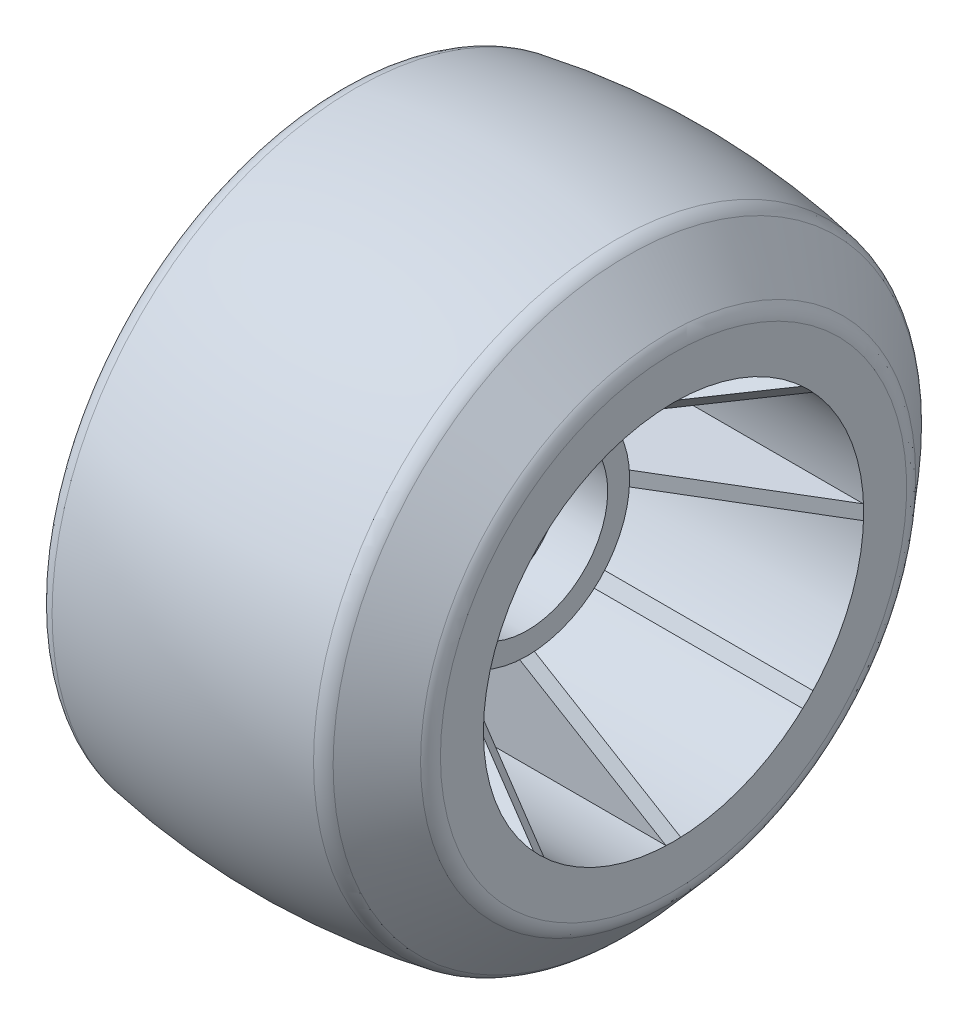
from build123d import *

# Parameters (mm, degrees)
CONG_1_R                     = 3
ESQUISSE2_R                  = 28
ENL_V_MAT_EXTRU_1_DEPTH      = 1.5
ESQUISSE3_R                  = 26
ENL_V_MAT_EXTRU_2_DEPTH      = 40
ESQUISSE4_R                  = 14
EXTRUSION1_DEPTH             = 20
NERVURE1_REACH               = 66.909
ESQUISSE5_WALL_W             = 155.142098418
ESQUISSE5_WALL_H             = 2
R_P_TITION_CIRCULAIRE1_COUNT = 8
ESQUISSE6_R                  = 11
ENL_V_MAT_EXTRU_3_DEPTH      = 6
ENL_V_START                  = -6
ESQUISSE7_R                  = 11
ENL_V_MAT_EXTRU_4_DEPTH      = 6
ESQUISSE8_R                  = 9.25
ENL_V_MAT_EXTRU_5_DEPTH      = 72.878001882


with BuildPart() as part:
    # Esquisse1 → R_volution2 (revolve)
    with BuildSketch(Plane.XY, mode=Mode.PRIVATE) as r_volution2_sk:
        with BuildLine():
            Line((-23, 0), (23, 0))
            Line((23, 0), (23, 33))
            Line((23, 33), (16, 41))
            ThreePointArc((16, 41), (-3.5, 42.919675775), (-23, 41))
            Line((-23, 41), (-23, 0))
        make_face()
    revolve(r_volution2_sk.sketch.rotate(Axis((-129.341829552, 0, 0), (1, 0, 0)), 90), axis=Axis((-129.341829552, 0, 0), (1, 0, 0)))

    # Cong_1
    cong_1_edges = [part.edges().sort_by_distance(p)[0] for p in [
        (-23, 0, -41),
        (16, 0, -41),
        (23, 0, -33),
    ]]
    fillet(cong_1_edges, radius=CONG_1_R)

    # Esquisse2 → Enl_v. mat.-Extru.1 (cut)
    with BuildSketch(Plane.ZY.offset(23)):
        Circle(ESQUISSE2_R)
    extrude(amount=-ENL_V_MAT_EXTRU_1_DEPTH, mode=Mode.SUBTRACT)

    # Esquisse3 → Enl_v. mat.-Extru.2 (cut)
    with BuildSketch(Plane(origin=(23, 0, 0), x_dir=(0, 0, -1), z_dir=(1, 0, 0))):
        Circle(ESQUISSE3_R)
    extrude(amount=-ENL_V_MAT_EXTRU_2_DEPTH, mode=Mode.SUBTRACT)

    # Esquisse4 → Extrusion1 (add)
    with BuildSketch(Plane(origin=(-17, 0, 0), x_dir=(0, 0, -1), z_dir=(1, 0, 0))):
        Circle(ESQUISSE4_R)
    extrude(amount=EXTRUSION1_DEPTH)

    # Esquisse5 wall → Nervure1 (add, up to next)
    with BuildSketch(Plane(origin=(13, 0, -20), x_dir=(0.857492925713, 0, -0.514495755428), z_dir=(-0.514495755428, 0, -0.857492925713)), mode=Mode.PRIVATE) as nervure1_sk1:
        Rectangle(ESQUISSE5_WALL_W, ESQUISSE5_WALL_H)
    nervure1_tool1 = extrude(nervure1_sk1.sketch, amount=NERVURE1_REACH, mode=Mode.PRIVATE) - part.part
    nervure1 = nervure1_tool1.solids().sort_by_distance((13, 0, -20))[0]
    add(nervure1)

    # R_p_tition circulaire1: Nervure1 ×8 about axis
    r_p_tition_circulaire1_axis = Axis((0, 0, 0), (1, 0, 0))
    for i in range(1, R_P_TITION_CIRCULAIRE1_COUNT):
        add(nervure1.rotate(r_p_tition_circulaire1_axis, i * 360 / R_P_TITION_CIRCULAIRE1_COUNT))

    # Esquisse6 → Enl_v. mat.-Extru.3 (cut)
    with BuildSketch(Plane(origin=(3, 0, 0), x_dir=(0, 0, -1), z_dir=(1, 0, 0))):
        Circle(ESQUISSE6_R)
    extrude(amount=-ENL_V_MAT_EXTRU_3_DEPTH, mode=Mode.SUBTRACT)

    # Esquisse7 → Enl_v. mat.-Extru.4 (cut)
    with BuildSketch(Plane.ZY.offset(21.5).offset(ENL_V_START)):
        with Locations(Location((0, 0, 0), (0, 0, 180))):
            Circle(ESQUISSE7_R)
    extrude(amount=ENL_V_MAT_EXTRU_4_DEPTH, mode=Mode.SUBTRACT)

    # Esquisse8 → Enl_v. mat.-Extru.5 (cut, through all)
    with BuildSketch(Plane.ZY.offset(15.5)):
        Circle(ESQUISSE8_R)
    extrude(amount=-ENL_V_MAT_EXTRU_5_DEPTH, mode=Mode.SUBTRACT)


solid = part.part
